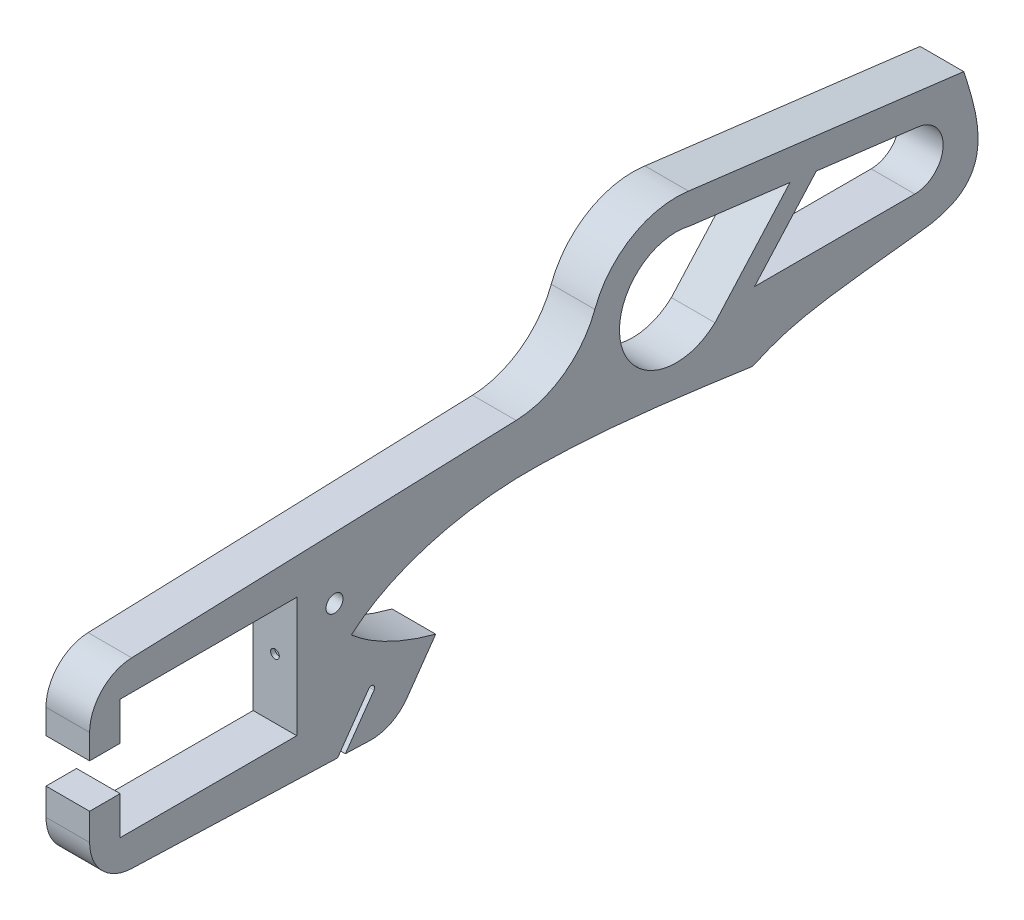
from build123d import *

# Parameters (mm, degrees)
ESQUISSE1_R             = 1.95
EXTRUSION1_DEPTH        = 10
ESQUISSE2_R             = 1
ENL_V_MAT_EXTRU_1_DEPTH = 1
ENL_V_MAT_EXTRU_2_DEPTH = 10


with BuildPart() as part:
    # Esquisse1 → Extrusion1 (new body)
    with BuildSketch(Plane(origin=(0, 0, 0), x_dir=(0, 0, -1), z_dir=(1, 0, 0))):
        with BuildLine():
            Line((-50.347882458, 20.646196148), (37.798125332, 23.714498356))
            ThreePointArc((37.798125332, 23.714498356), (48.800102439, 27.480098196), (55.847563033, 36.729776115))
            ThreePointArc((55.847563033, 36.729776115), (64.337548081, 46.9009527), (77.33180903, 49.485882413))
            Line((77.33180903, 49.485882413), (140.434725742, 41.661330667))
            add(Edge.make_bspline(
                [(92.023809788, 7.328624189), (101.615923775, 11.780874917), (108.386266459, 12.289330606), (147.693113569, 16.831016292), (144.567757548, 28.98603807), (140.434725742, 41.661330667)],
                knots=[0.115775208, 0.115775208, 0.115775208, 0.115775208, 0.613382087, 0.613382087, 0.980332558, 0.980332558, 0.980332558, 0.980332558], degree=3))
            add(Edge.make_bspline(
                [(0, 0), (10.022909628, 8.674688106), (26.503916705, 12.143416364), (52.950245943, 12.25429516), (70.587506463, 10.361796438), (88.025709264, 7.897541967), (92.023809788, 7.328624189)],
                knots=[0, 0, 0, 0, 0.28007959, 0.28007959, 0.548831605, 0.629025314, 0.629025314, 0.629025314, 0.629025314], degree=3))
            add(Edge.make_bspline(
                [(0, 0), (5.168651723, -4.473395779), (12.054703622, -7.562372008), (19.36318086, -9.5129247)],
                knots=[0, 0, 0, 0, 0.144432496, 0.144432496, 0.144432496, 0.144432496], degree=3))
            Line((19.36318086, -9.5129247), (12.796601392, -18.859135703))
            ThreePointArc((12.796601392, -18.859135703), (9.069582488, -22.06294258), (4.266378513, -23.104230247))
            Line((4.266378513, -23.104230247), (-50.347882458, -21.203145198))
            ThreePointArc((-50.347882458, -21.203145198), (-57.193011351, -18.156182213), (-60, -11.20919814))
            Line((-60, -11.20919814), (-60, -5))
            Line((-60, -5), (-53, -5))
            Line((-53, -5), (-53, -13.75))
            Line((-53, -13.75), (-12.5, -13.75))
            Line((-12.5, -13.75), (-12.5, 13.75))
            Line((-12.5, 13.75), (-53, 13.75))
            Line((-53, 13.75), (-53, 5))
            Line((-53, 5), (-60, 5))
            Line((-60, 5), (-60, 10.65224909))
            ThreePointArc((-60, 10.65224909), (-57.193011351, 17.599233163), (-50.347882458, 20.646196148))
        make_face()
        with Locations((-3.855193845, 8.187707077)):
            Circle(ESQUISSE1_R, mode=Mode.SUBTRACT)
        with BuildLine():
            Line((83.392047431, 20.315075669), (100.59021528, 39.557820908))
            Line((100.59021528, 39.557820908), (77.670034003, 42.399847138))
            ThreePointArc((77.670034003, 42.399847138), (61.910470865, 26.53299895), (83.392047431, 20.315075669))
        make_face(mode=Mode.SUBTRACT)
        with BuildLine():
            Line((106.62713402, 38.809263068), (92.460492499, 22.95844244))
            Line((92.460492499, 22.95844244), (129.203396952, 22.95844244))
            ThreePointArc((129.203396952, 22.95844244), (135.69186057, 29.058530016), (130.003351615, 35.910689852))
            Line((130.003351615, 35.910689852), (106.62713402, 38.809263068))
        make_face(mode=Mode.SUBTRACT)
    extrude(amount=EXTRUSION1_DEPTH)

    # Esquisse2 → Enl_v. mat.-Extru.1 (cut)
    with BuildSketch(Plane.XY.offset(12.5)):
        with Locations((5, 0)):
            Circle(ESQUISSE2_R)
    extrude(amount=-ENL_V_MAT_EXTRU_1_DEPTH, mode=Mode.SUBTRACT)

    # Esquisse3 → Enl_v. mat.-Extru.2 (cut)
    with BuildSketch(Plane.ZY):
        with BuildLine():
            Line((-4.000585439, -12.679119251), (3.679233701, -23.609804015))
            Line((3.679233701, -23.609804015), (2.451882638, -24.472131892))
            Line((2.451882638, -24.472131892), (-5.227936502, -13.541447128))
            ThreePointArc((-5.227936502, -13.541447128), (-5.045424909, -12.496607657), (-4.000585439, -12.679119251))
        make_face()
    extrude(amount=-ENL_V_MAT_EXTRU_2_DEPTH, mode=Mode.SUBTRACT)


solid = part.part
